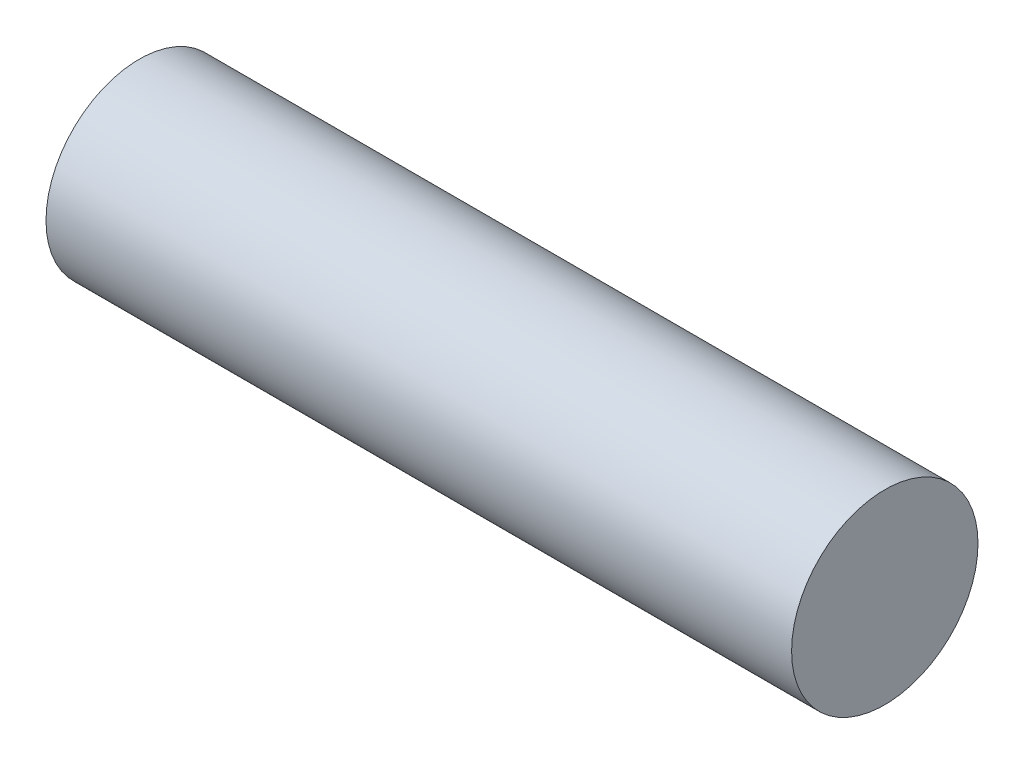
from build123d import *

# Parameters (mm, degrees)
SKETCH1_R           = 3.175
BOSS_EXTRUDE1_DEPTH = 25.4


with BuildPart() as part:
    # Sketch1 → Boss-Extrude1 (new body)
    with BuildSketch(Plane.YZ):
        with Locations(Location((0, 0, 0), (0, 0, 270))):
            Circle(SKETCH1_R)
    extrude(amount=BOSS_EXTRUDE1_DEPTH)


solid = part.part
